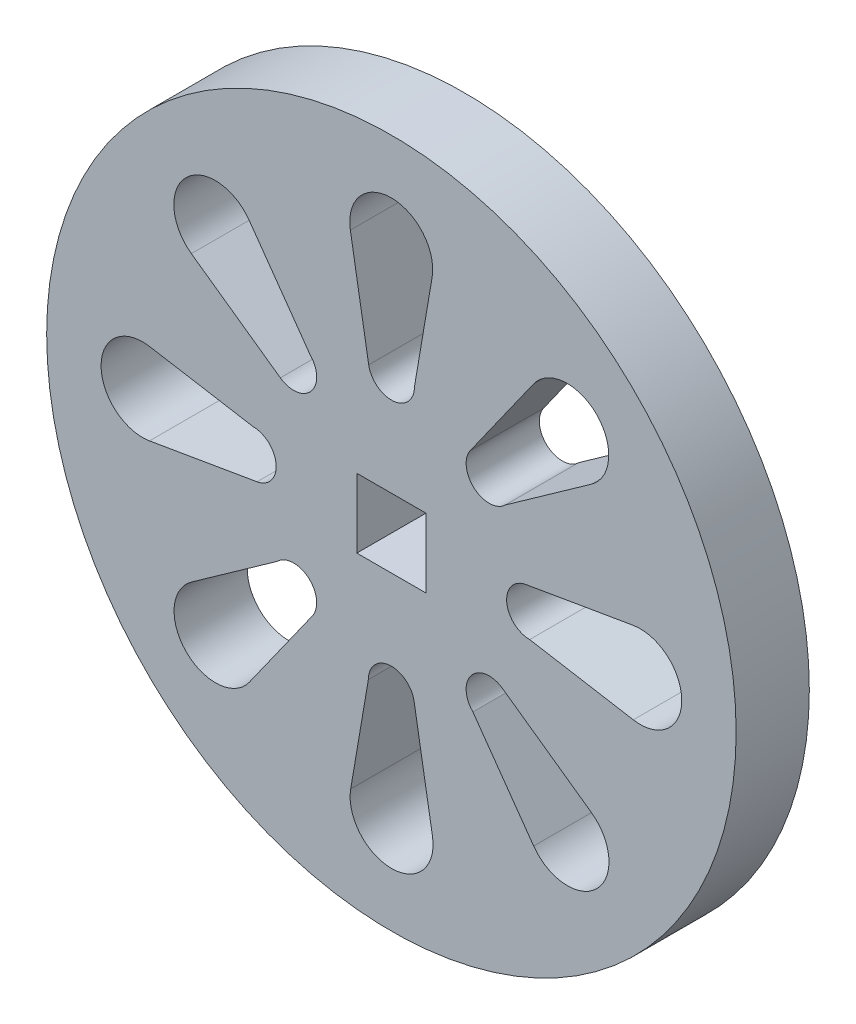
from build123d import *

# Parameters (mm, degrees)
SKETCH1_R           = 47.5
BOSS_EXTRUDE1_DEPTH = 10.0838
SKETCH2_W           = 9.525
SKETCH2_H           = 9.525
CUT_EXTRUDE1_DEPTH  = 68.927777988
CUT_EXTRUDE3_DEPTH  = 68.927777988
CIRPATTERN2_COUNT   = 8


with BuildPart() as part:
    # Sketch1 → Boss-Extrude1 (new body)
    with BuildSketch(Plane.XY):
        Circle(SKETCH1_R)
    extrude(amount=BOSS_EXTRUDE1_DEPTH)

    # Sketch2 → Cut-Extrude1 (cut, through all)
    with BuildSketch(Plane.XY.offset(10.0838)):
        Rectangle(SKETCH2_W, SKETCH2_H)
    extrude(amount=-CUT_EXTRUDE1_DEPTH, mode=Mode.SUBTRACT)

    # Sketch4 → Cut-Extrude3 (cut, through all)
    with BuildSketch(Plane.XY.offset(10.0838)):
        with BuildLine():
            Line((-3.129792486, 18.516123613), (-5.656556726, 33.329005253))
            ThreePointArc((-5.656556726, 33.329005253), (-0.022930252, 40.004982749), (5.610696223, 33.329005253))
            Line((5.610696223, 33.329005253), (3.175, 19.05))
            ThreePointArc((3.175, 19.05), (0.267893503, 15.886322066), (-3.129792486, 18.516123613))
        make_face()
    cut_extrude3 = extrude(amount=-CUT_EXTRUDE3_DEPTH, mode=Mode.SUBTRACT)

    # CirPattern2: Cut-Extrude3 ×8 about axis
    cirpattern2_axis = Axis((0, 0, 0), (0, 0, 1))
    for i in range(1, CIRPATTERN2_COUNT):
        add(cut_extrude3.rotate(cirpattern2_axis, i * 360 / CIRPATTERN2_COUNT), mode=Mode.SUBTRACT)


solid = part.part
